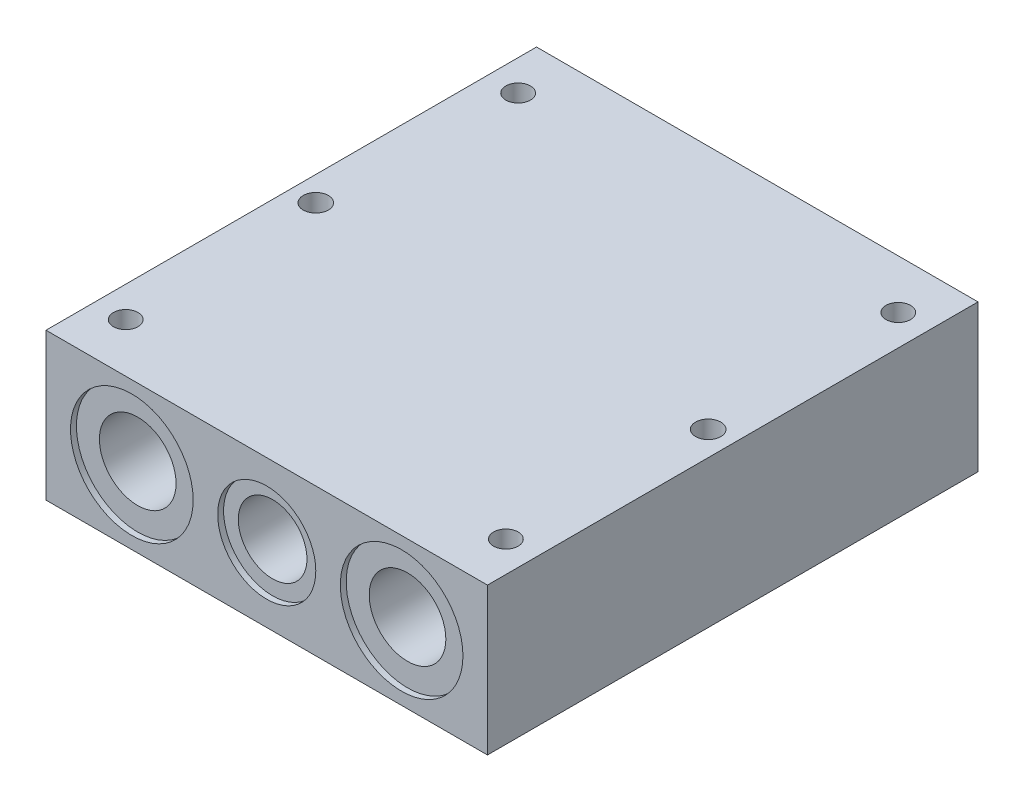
ISO-10303-21;
HEADER;
FILE_DESCRIPTION(('STEP AP214'),'2;1');
FILE_NAME('part.step','',(''),(''),'','','');
FILE_SCHEMA(('AUTOMOTIVE_DESIGN { 1 0 10303 214 1 1 1 1 }'));
ENDSEC;
DATA;
#1=APPLICATION_CONTEXT('core data for automotive mechanical design processes');
#2=APPLICATION_PROTOCOL_DEFINITION('international standard','automotive_design',2000,#1);
#3=PRODUCT_CONTEXT('',#1,'mechanical');
#4=PRODUCT('Part','Part','',(#3));
#5=PRODUCT_RELATED_PRODUCT_CATEGORY('part','',(#4));
#6=PRODUCT_DEFINITION_FORMATION('','',#4);
#7=PRODUCT_DEFINITION_CONTEXT('part definition',#1,'design');
#8=PRODUCT_DEFINITION('design','',#6,#7);
#9=PRODUCT_DEFINITION_SHAPE('','',#8);
#10=(LENGTH_UNIT() NAMED_UNIT(*) SI_UNIT(.MILLI.,.METRE.));
#11=(NAMED_UNIT(*) PLANE_ANGLE_UNIT() SI_UNIT($,.RADIAN.));
#12=(NAMED_UNIT(*) SI_UNIT($,.STERADIAN.) SOLID_ANGLE_UNIT());
#13=UNCERTAINTY_MEASURE_WITH_UNIT(LENGTH_MEASURE(1.E-05),#10,'distance_accuracy_value','');
#14=(GEOMETRIC_REPRESENTATION_CONTEXT(3) GLOBAL_UNCERTAINTY_ASSIGNED_CONTEXT((#13)) GLOBAL_UNIT_ASSIGNED_CONTEXT((#10,
#11,#12)) REPRESENTATION_CONTEXT('',''));
#15=CARTESIAN_POINT('',(0.,0.,0.));
#16=DIRECTION('',(0.,0.,1.));
#17=DIRECTION('',(1.,0.,0.));
#18=AXIS2_PLACEMENT_3D('',#15,#16,#17);
#19=CARTESIAN_POINT('',(0.,0.,-63.5));
#20=DIRECTION('',(0.,0.,1.));
#21=DIRECTION('',(1.,0.,0.));
#22=AXIS2_PLACEMENT_3D('',#19,#20,#21);
#23=CYLINDRICAL_SURFACE('',#22,8.89);
#24=CARTESIAN_POINT('',(0.,0.,61.976));
#25=DIRECTION('',(0.,0.,1.));
#26=DIRECTION('',(1.,0.,0.));
#27=AXIS2_PLACEMENT_3D('',#24,#25,#26);
#28=CIRCLE('',#27,8.89);
#29=CARTESIAN_POINT('',(8.89,0.,61.976));
#30=VERTEX_POINT('',#29);
#31=EDGE_CURVE('E128',#30,#30,#28,.F.);
#32=ORIENTED_EDGE('',*,*,#31,.F.);
#33=EDGE_LOOP('',(#32));
#34=FACE_BOUND('',#33,.T.);
#35=CARTESIAN_POINT('',(0.,0.,-61.976));
#36=DIRECTION('',(0.,0.,-1.));
#37=DIRECTION('',(-1.,0.,0.));
#38=AXIS2_PLACEMENT_3D('',#35,#36,#37);
#39=CIRCLE('',#38,8.89);
#40=CARTESIAN_POINT('',(-8.89,0.,-61.976));
#41=VERTEX_POINT('',#40);
#42=EDGE_CURVE('E39',#41,#41,#39,.F.);
#43=ORIENTED_EDGE('',*,*,#42,.F.);
#44=EDGE_LOOP('',(#43));
#45=FACE_BOUND('',#44,.T.);
#46=ADVANCED_FACE('F35',(#34,#45),#23,.F.);
#47=CARTESIAN_POINT('',(34.925,0.,-63.5));
#48=DIRECTION('',(0.,0.,1.));
#49=DIRECTION('',(1.,0.,0.));
#50=AXIS2_PLACEMENT_3D('',#47,#48,#49);
#51=CYLINDRICAL_SURFACE('',#50,9.921875);
#52=CARTESIAN_POINT('',(34.925,0.,61.976));
#53=DIRECTION('',(0.,0.,1.));
#54=DIRECTION('',(1.,0.,0.));
#55=AXIS2_PLACEMENT_3D('',#52,#53,#54);
#56=CIRCLE('',#55,9.921875);
#57=CARTESIAN_POINT('',(44.846875,0.,61.976));
#58=VERTEX_POINT('',#57);
#59=EDGE_CURVE('E105',#58,#58,#56,.F.);
#60=ORIENTED_EDGE('',*,*,#59,.F.);
#61=EDGE_LOOP('',(#60));
#62=FACE_BOUND('',#61,.T.);
#63=CARTESIAN_POINT('',(34.925,0.,-61.976));
#64=DIRECTION('',(0.,0.,-1.));
#65=DIRECTION('',(-1.,0.,0.));
#66=AXIS2_PLACEMENT_3D('',#63,#64,#65);
#67=CIRCLE('',#66,9.921875);
#68=CARTESIAN_POINT('',(25.003125,0.,-61.976));
#69=VERTEX_POINT('',#68);
#70=EDGE_CURVE('E124',#69,#69,#67,.F.);
#71=ORIENTED_EDGE('',*,*,#70,.F.);
#72=EDGE_LOOP('',(#71));
#73=FACE_BOUND('',#72,.T.);
#74=ADVANCED_FACE('F177',(#62,#73),#51,.F.);
#75=CARTESIAN_POINT('',(-34.925,0.,-63.5));
#76=DIRECTION('',(0.,0.,1.));
#77=DIRECTION('',(1.,0.,0.));
#78=AXIS2_PLACEMENT_3D('',#75,#76,#77);
#79=CYLINDRICAL_SURFACE('',#78,9.921875);
#80=CARTESIAN_POINT('',(-34.925,0.,61.976));
#81=DIRECTION('',(0.,0.,1.));
#82=DIRECTION('',(1.,0.,0.));
#83=AXIS2_PLACEMENT_3D('',#80,#81,#82);
#84=CIRCLE('',#83,9.921875);
#85=CARTESIAN_POINT('',(-25.003125,0.,61.976));
#86=VERTEX_POINT('',#85);
#87=EDGE_CURVE('E114',#86,#86,#84,.F.);
#88=ORIENTED_EDGE('',*,*,#87,.F.);
#89=EDGE_LOOP('',(#88));
#90=FACE_BOUND('',#89,.T.);
#91=CARTESIAN_POINT('',(-34.925,0.,-61.976));
#92=DIRECTION('',(0.,0.,-1.));
#93=DIRECTION('',(-1.,0.,0.));
#94=AXIS2_PLACEMENT_3D('',#91,#92,#93);
#95=CIRCLE('',#94,9.921875);
#96=CARTESIAN_POINT('',(-44.846875,0.,-61.976));
#97=VERTEX_POINT('',#96);
#98=EDGE_CURVE('E119',#97,#97,#95,.F.);
#99=ORIENTED_EDGE('',*,*,#98,.F.);
#100=EDGE_LOOP('',(#99));
#101=FACE_BOUND('',#100,.T.);
#102=ADVANCED_FACE('F172',(#90,#101),#79,.F.);
#103=CARTESIAN_POINT('',(-57.15,19.05,-63.5));
#104=DIRECTION('',(1.,0.,0.));
#105=DIRECTION('',(0.,0.,-1.));
#106=AXIS2_PLACEMENT_3D('',#103,#104,#105);
#107=PLANE('',#106);
#108=DIRECTION('',(0.,0.,1.));
#109=VECTOR('',#108,1.);
#110=CARTESIAN_POINT('',(-57.15,-19.05,-63.5));
#111=LINE('',#110,#109);
#112=CARTESIAN_POINT('',(-57.15,-19.05,-63.5));
#113=VERTEX_POINT('',#112);
#114=CARTESIAN_POINT('',(-57.15,-19.05,63.5));
#115=VERTEX_POINT('',#114);
#116=EDGE_CURVE('E102',#113,#115,#111,.T.);
#117=ORIENTED_EDGE('',*,*,#116,.T.);
#118=DIRECTION('',(0.,-1.,0.));
#119=VECTOR('',#118,1.);
#120=CARTESIAN_POINT('',(-57.15,19.05,63.5));
#121=LINE('',#120,#119);
#122=CARTESIAN_POINT('',(-57.15,19.05,63.5));
#123=VERTEX_POINT('',#122);
#124=EDGE_CURVE('E11',#123,#115,#121,.T.);
#125=ORIENTED_EDGE('',*,*,#124,.F.);
#126=DIRECTION('',(0.,0.,1.));
#127=VECTOR('',#126,1.);
#128=CARTESIAN_POINT('',(-57.15,19.05,-63.5));
#129=LINE('',#128,#127);
#130=CARTESIAN_POINT('',(-57.15,19.05,-63.5));
#131=VERTEX_POINT('',#130);
#132=EDGE_CURVE('E89',#131,#123,#129,.T.);
#133=ORIENTED_EDGE('',*,*,#132,.F.);
#134=DIRECTION('',(0.,-1.,0.));
#135=VECTOR('',#134,1.);
#136=CARTESIAN_POINT('',(-57.15,19.05,-63.5));
#137=LINE('',#136,#135);
#138=EDGE_CURVE('E98',#131,#113,#137,.T.);
#139=ORIENTED_EDGE('',*,*,#138,.T.);
#140=EDGE_LOOP('',(#117,#125,#133,#139));
#141=FACE_BOUND('',#140,.T.);
#142=ADVANCED_FACE('F37',(#141),#107,.F.);
#143=CARTESIAN_POINT('',(-57.15,19.05,63.5));
#144=DIRECTION('',(0.,0.,-1.));
#145=DIRECTION('',(-1.,0.,0.));
#146=AXIS2_PLACEMENT_3D('',#143,#144,#145);
#147=PLANE('',#146);
#148=CARTESIAN_POINT('',(0.,0.,63.5));
#149=DIRECTION('',(0.,0.,1.));
#150=DIRECTION('',(1.,0.,0.));
#151=AXIS2_PLACEMENT_3D('',#148,#149,#150);
#152=CIRCLE('',#151,12.7);
#153=CARTESIAN_POINT('',(12.7,0.,63.5));
#154=VERTEX_POINT('',#153);
#155=EDGE_CURVE('E137',#154,#154,#152,.T.);
#156=ORIENTED_EDGE('',*,*,#155,.F.);
#157=EDGE_LOOP('',(#156));
#158=FACE_BOUND('',#157,.T.);
#159=CARTESIAN_POINT('',(-34.925,0.,63.5));
#160=DIRECTION('',(0.,0.,1.));
#161=DIRECTION('',(1.,0.,0.));
#162=AXIS2_PLACEMENT_3D('',#159,#160,#161);
#163=CIRCLE('',#162,15.875);
#164=CARTESIAN_POINT('',(-19.05,0.,63.5));
#165=VERTEX_POINT('',#164);
#166=EDGE_CURVE('E122',#165,#165,#163,.T.);
#167=ORIENTED_EDGE('',*,*,#166,.F.);
#168=EDGE_LOOP('',(#167));
#169=FACE_BOUND('',#168,.T.);
#170=CARTESIAN_POINT('',(34.925,0.,63.5));
#171=DIRECTION('',(0.,0.,1.));
#172=DIRECTION('',(1.,0.,0.));
#173=AXIS2_PLACEMENT_3D('',#170,#171,#172);
#174=CIRCLE('',#173,15.875);
#175=CARTESIAN_POINT('',(50.8,0.,63.5));
#176=VERTEX_POINT('',#175);
#177=EDGE_CURVE('E117',#176,#176,#174,.T.);
#178=ORIENTED_EDGE('',*,*,#177,.F.);
#179=EDGE_LOOP('',(#178));
#180=FACE_BOUND('',#179,.T.);
#181=DIRECTION('',(1.,0.,0.));
#182=VECTOR('',#181,1.);
#183=CARTESIAN_POINT('',(-57.15,-19.05,63.5));
#184=LINE('',#183,#182);
#185=CARTESIAN_POINT('',(57.15,-19.05,63.5));
#186=VERTEX_POINT('',#185);
#187=EDGE_CURVE('E93',#115,#186,#184,.T.);
#188=ORIENTED_EDGE('',*,*,#187,.T.);
#189=DIRECTION('',(0.,-1.,0.));
#190=VECTOR('',#189,1.);
#191=CARTESIAN_POINT('',(57.15,19.05,63.5));
#192=LINE('',#191,#190);
#193=CARTESIAN_POINT('',(57.15,19.05,63.5));
#194=VERTEX_POINT('',#193);
#195=EDGE_CURVE('E45',#194,#186,#192,.T.);
#196=ORIENTED_EDGE('',*,*,#195,.F.);
#197=DIRECTION('',(1.,0.,0.));
#198=VECTOR('',#197,1.);
#199=CARTESIAN_POINT('',(-57.15,19.05,63.5));
#200=LINE('',#199,#198);
#201=EDGE_CURVE('E84',#123,#194,#200,.T.);
#202=ORIENTED_EDGE('',*,*,#201,.F.);
#203=ORIENTED_EDGE('',*,*,#124,.T.);
#204=EDGE_LOOP('',(#188,#196,#202,#203));
#205=FACE_BOUND('',#204,.T.);
#206=ADVANCED_FACE('F92',(#158,#169,#180,#205),#147,.F.);
#207=CARTESIAN_POINT('',(57.15,19.05,-63.5));
#208=DIRECTION('',(-1.,0.,0.));
#209=DIRECTION('',(0.,0.,1.));
#210=AXIS2_PLACEMENT_3D('',#207,#208,#209);
#211=PLANE('',#210);
#212=DIRECTION('',(0.,0.,-1.));
#213=VECTOR('',#212,1.);
#214=CARTESIAN_POINT('',(57.15,-19.05,-63.5));
#215=LINE('',#214,#213);
#216=CARTESIAN_POINT('',(57.15,-19.05,-63.5));
#217=VERTEX_POINT('',#216);
#218=EDGE_CURVE('E71',#186,#217,#215,.T.);
#219=ORIENTED_EDGE('',*,*,#218,.T.);
#220=DIRECTION('',(0.,-1.,0.));
#221=VECTOR('',#220,1.);
#222=CARTESIAN_POINT('',(57.15,19.05,-63.5));
#223=LINE('',#222,#221);
#224=CARTESIAN_POINT('',(57.15,19.05,-63.5));
#225=VERTEX_POINT('',#224);
#226=EDGE_CURVE('E94',#225,#217,#223,.T.);
#227=ORIENTED_EDGE('',*,*,#226,.F.);
#228=DIRECTION('',(0.,0.,-1.));
#229=VECTOR('',#228,1.);
#230=CARTESIAN_POINT('',(57.15,19.05,-63.5));
#231=LINE('',#230,#229);
#232=EDGE_CURVE('E87',#194,#225,#231,.T.);
#233=ORIENTED_EDGE('',*,*,#232,.F.);
#234=ORIENTED_EDGE('',*,*,#195,.T.);
#235=EDGE_LOOP('',(#219,#227,#233,#234));
#236=FACE_BOUND('',#235,.T.);
#237=ADVANCED_FACE('F96',(#236),#211,.F.);
#238=CARTESIAN_POINT('',(-57.15,19.05,-63.5));
#239=DIRECTION('',(0.,0.,1.));
#240=DIRECTION('',(1.,0.,0.));
#241=AXIS2_PLACEMENT_3D('',#238,#239,#240);
#242=PLANE('',#241);
#243=CARTESIAN_POINT('',(0.,0.,-63.5));
#244=DIRECTION('',(0.,0.,-1.));
#245=DIRECTION('',(-1.,0.,0.));
#246=AXIS2_PLACEMENT_3D('',#243,#244,#245);
#247=CIRCLE('',#246,12.7);
#248=CARTESIAN_POINT('',(-12.7,0.,-63.5));
#249=VERTEX_POINT('',#248);
#250=EDGE_CURVE('E144',#249,#249,#247,.T.);
#251=ORIENTED_EDGE('',*,*,#250,.F.);
#252=EDGE_LOOP('',(#251));
#253=FACE_BOUND('',#252,.T.);
#254=CARTESIAN_POINT('',(34.925,0.,-63.5));
#255=DIRECTION('',(0.,0.,-1.));
#256=DIRECTION('',(-1.,0.,0.));
#257=AXIS2_PLACEMENT_3D('',#254,#255,#256);
#258=CIRCLE('',#257,15.875);
#259=CARTESIAN_POINT('',(19.05,0.,-63.5));
#260=VERTEX_POINT('',#259);
#261=EDGE_CURVE('E130',#260,#260,#258,.T.);
#262=ORIENTED_EDGE('',*,*,#261,.F.);
#263=EDGE_LOOP('',(#262));
#264=FACE_BOUND('',#263,.T.);
#265=CARTESIAN_POINT('',(-34.925,0.,-63.5));
#266=DIRECTION('',(0.,0.,-1.));
#267=DIRECTION('',(-1.,0.,0.));
#268=AXIS2_PLACEMENT_3D('',#265,#266,#267);
#269=CIRCLE('',#268,15.875);
#270=CARTESIAN_POINT('',(-50.8,0.,-63.5));
#271=VERTEX_POINT('',#270);
#272=EDGE_CURVE('E126',#271,#271,#269,.T.);
#273=ORIENTED_EDGE('',*,*,#272,.F.);
#274=EDGE_LOOP('',(#273));
#275=FACE_BOUND('',#274,.T.);
#276=DIRECTION('',(-1.,0.,0.));
#277=VECTOR('',#276,1.);
#278=CARTESIAN_POINT('',(-57.15,-19.05,-63.5));
#279=LINE('',#278,#277);
#280=EDGE_CURVE('E77',#217,#113,#279,.T.);
#281=ORIENTED_EDGE('',*,*,#280,.T.);
#282=ORIENTED_EDGE('',*,*,#138,.F.);
#283=DIRECTION('',(-1.,0.,0.));
#284=VECTOR('',#283,1.);
#285=CARTESIAN_POINT('',(-57.15,19.05,-63.5));
#286=LINE('',#285,#284);
#287=EDGE_CURVE('E54',#225,#131,#286,.T.);
#288=ORIENTED_EDGE('',*,*,#287,.F.);
#289=ORIENTED_EDGE('',*,*,#226,.T.);
#290=EDGE_LOOP('',(#281,#282,#288,#289));
#291=FACE_BOUND('',#290,.T.);
#292=ADVANCED_FACE('F170',(#253,#264,#275,#291),#242,.F.);
#293=CARTESIAN_POINT('',(-57.15,19.05,63.5));
#294=DIRECTION('',(0.,1.,0.));
#295=DIRECTION('',(0.,0.,1.));
#296=AXIS2_PLACEMENT_3D('',#293,#294,#295);
#297=PLANE('',#296);
#298=CARTESIAN_POINT('',(-49.2125,19.05,50.8));
#299=DIRECTION('',(0.,1.,0.));
#300=DIRECTION('',(0.,0.,1.));
#301=AXIS2_PLACEMENT_3D('',#298,#299,#300);
#302=CIRCLE('',#301,3.18770000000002);
#303=CARTESIAN_POINT('',(-49.2125,19.05,53.9877));
#304=VERTEX_POINT('',#303);
#305=EDGE_CURVE('E283',#304,#304,#302,.T.);
#306=ORIENTED_EDGE('',*,*,#305,.F.);
#307=EDGE_LOOP('',(#306));
#308=FACE_BOUND('',#307,.T.);
#309=CARTESIAN_POINT('',(-49.2125,19.05,-50.8));
#310=DIRECTION('',(0.,1.,0.));
#311=DIRECTION('',(0.,0.,1.));
#312=AXIS2_PLACEMENT_3D('',#309,#310,#311);
#313=CIRCLE('',#312,3.18770000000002);
#314=CARTESIAN_POINT('',(-49.2125,19.05,-47.6123));
#315=VERTEX_POINT('',#314);
#316=EDGE_CURVE('E277',#315,#315,#313,.T.);
#317=ORIENTED_EDGE('',*,*,#316,.F.);
#318=EDGE_LOOP('',(#317));
#319=FACE_BOUND('',#318,.T.);
#320=CARTESIAN_POINT('',(49.2125,19.05,-50.8));
#321=DIRECTION('',(0.,1.,0.));
#322=DIRECTION('',(0.,0.,1.));
#323=AXIS2_PLACEMENT_3D('',#320,#321,#322);
#324=CIRCLE('',#323,3.18770000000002);
#325=CARTESIAN_POINT('',(49.2125,19.05,-47.6123));
#326=VERTEX_POINT('',#325);
#327=EDGE_CURVE('E271',#326,#326,#324,.T.);
#328=ORIENTED_EDGE('',*,*,#327,.F.);
#329=EDGE_LOOP('',(#328));
#330=FACE_BOUND('',#329,.T.);
#331=CARTESIAN_POINT('',(49.2125,19.05,50.8));
#332=DIRECTION('',(0.,1.,0.));
#333=DIRECTION('',(0.,0.,1.));
#334=AXIS2_PLACEMENT_3D('',#331,#332,#333);
#335=CIRCLE('',#334,3.18770000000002);
#336=CARTESIAN_POINT('',(49.2125,19.05,53.9877));
#337=VERTEX_POINT('',#336);
#338=EDGE_CURVE('E265',#337,#337,#335,.T.);
#339=ORIENTED_EDGE('',*,*,#338,.F.);
#340=EDGE_LOOP('',(#339));
#341=FACE_BOUND('',#340,.T.);
#342=CARTESIAN_POINT('',(-50.8,19.05,0.));
#343=DIRECTION('',(0.,1.,0.));
#344=DIRECTION('',(0.,0.,1.));
#345=AXIS2_PLACEMENT_3D('',#342,#343,#344);
#346=CIRCLE('',#345,3.26389999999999);
#347=CARTESIAN_POINT('',(-50.8,19.05,3.26389999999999));
#348=VERTEX_POINT('',#347);
#349=EDGE_CURVE('E254',#348,#348,#346,.T.);
#350=ORIENTED_EDGE('',*,*,#349,.F.);
#351=EDGE_LOOP('',(#350));
#352=FACE_BOUND('',#351,.T.);
#353=CARTESIAN_POINT('',(50.8,19.05,0.));
#354=DIRECTION('',(0.,1.,0.));
#355=DIRECTION('',(0.,0.,1.));
#356=AXIS2_PLACEMENT_3D('',#353,#354,#355);
#357=CIRCLE('',#356,3.26389999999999);
#358=CARTESIAN_POINT('',(50.8,19.05,3.26389999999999));
#359=VERTEX_POINT('',#358);
#360=EDGE_CURVE('E246',#359,#359,#357,.T.);
#361=ORIENTED_EDGE('',*,*,#360,.F.);
#362=EDGE_LOOP('',(#361));
#363=FACE_BOUND('',#362,.T.);
#364=ORIENTED_EDGE('',*,*,#132,.T.);
#365=ORIENTED_EDGE('',*,*,#201,.T.);
#366=ORIENTED_EDGE('',*,*,#232,.T.);
#367=ORIENTED_EDGE('',*,*,#287,.T.);
#368=EDGE_LOOP('',(#364,#365,#366,#367));
#369=FACE_BOUND('',#368,.T.);
#370=ADVANCED_FACE('F85',(#308,#319,#330,#341,#352,#363,#369),#297,.T.);
#371=CARTESIAN_POINT('',(-57.15,-19.05,63.5));
#372=DIRECTION('',(0.,1.,0.));
#373=DIRECTION('',(0.,0.,1.));
#374=AXIS2_PLACEMENT_3D('',#371,#372,#373);
#375=PLANE('',#374);
#376=CARTESIAN_POINT('',(-50.8,-19.05,0.));
#377=DIRECTION('',(0.,1.,0.));
#378=DIRECTION('',(0.,0.,1.));
#379=AXIS2_PLACEMENT_3D('',#376,#377,#378);
#380=CIRCLE('',#379,3.26389999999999);
#381=CARTESIAN_POINT('',(-50.8,-19.05,3.26389999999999));
#382=VERTEX_POINT('',#381);
#383=EDGE_CURVE('E259',#382,#382,#380,.T.);
#384=ORIENTED_EDGE('',*,*,#383,.T.);
#385=EDGE_LOOP('',(#384));
#386=FACE_BOUND('',#385,.T.);
#387=CARTESIAN_POINT('',(50.8,-19.05,0.));
#388=DIRECTION('',(0.,1.,0.));
#389=DIRECTION('',(0.,0.,1.));
#390=AXIS2_PLACEMENT_3D('',#387,#388,#389);
#391=CIRCLE('',#390,3.26389999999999);
#392=CARTESIAN_POINT('',(50.8,-19.05,3.26389999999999));
#393=VERTEX_POINT('',#392);
#394=EDGE_CURVE('E249',#393,#393,#391,.T.);
#395=ORIENTED_EDGE('',*,*,#394,.T.);
#396=EDGE_LOOP('',(#395));
#397=FACE_BOUND('',#396,.T.);
#398=ORIENTED_EDGE('',*,*,#116,.F.);
#399=ORIENTED_EDGE('',*,*,#280,.F.);
#400=ORIENTED_EDGE('',*,*,#218,.F.);
#401=ORIENTED_EDGE('',*,*,#187,.F.);
#402=EDGE_LOOP('',(#398,#399,#400,#401));
#403=FACE_BOUND('',#402,.T.);
#404=ADVANCED_FACE('F218',(#386,#397,#403),#375,.F.);
#405=CARTESIAN_POINT('',(34.925,0.,61.976));
#406=DIRECTION('',(0.,0.,1.));
#407=DIRECTION('',(1.,0.,0.));
#408=AXIS2_PLACEMENT_3D('',#405,#406,#407);
#409=PLANE('',#408);
#410=CARTESIAN_POINT('',(34.925,0.,61.976));
#411=DIRECTION('',(0.,0.,1.));
#412=DIRECTION('',(1.,0.,0.));
#413=AXIS2_PLACEMENT_3D('',#410,#411,#412);
#414=CIRCLE('',#413,15.875);
#415=CARTESIAN_POINT('',(50.8,0.,61.976));
#416=VERTEX_POINT('',#415);
#417=EDGE_CURVE('E113',#416,#416,#414,.T.);
#418=ORIENTED_EDGE('',*,*,#417,.T.);
#419=EDGE_LOOP('',(#418));
#420=FACE_BOUND('',#419,.T.);
#421=ORIENTED_EDGE('',*,*,#59,.T.);
#422=EDGE_LOOP('',(#421));
#423=FACE_BOUND('',#422,.T.);
#424=ADVANCED_FACE('F215',(#420,#423),#409,.T.);
#425=CARTESIAN_POINT('',(34.925,0.,61.976));
#426=DIRECTION('',(0.,0.,1.));
#427=DIRECTION('',(1.,0.,0.));
#428=AXIS2_PLACEMENT_3D('',#425,#426,#427);
#429=CYLINDRICAL_SURFACE('',#428,15.875);
#430=CARTESIAN_POINT('',(50.8,0.,61.976));
#431=CARTESIAN_POINT('',(50.8,0.,61.991875));
#432=CARTESIAN_POINT('',(50.8,0.,62.00775));
#433=CARTESIAN_POINT('',(50.8,0.,62.0395));
#434=CARTESIAN_POINT('',(50.8,0.,62.055375));
#435=CARTESIAN_POINT('',(50.8,0.,62.087125));
#436=CARTESIAN_POINT('',(50.8,0.,62.103));
#437=CARTESIAN_POINT('',(50.8,0.,62.13475));
#438=CARTESIAN_POINT('',(50.8,0.,62.150625));
#439=CARTESIAN_POINT('',(50.8,0.,62.182375));
#440=CARTESIAN_POINT('',(50.8,0.,62.19825));
#441=CARTESIAN_POINT('',(50.8,0.,62.23));
#442=CARTESIAN_POINT('',(50.8,0.,62.245875));
#443=CARTESIAN_POINT('',(50.8,0.,62.277625));
#444=CARTESIAN_POINT('',(50.8,0.,62.2935));
#445=CARTESIAN_POINT('',(50.8,0.,62.32525));
#446=CARTESIAN_POINT('',(50.8,0.,62.341125));
#447=CARTESIAN_POINT('',(50.8,0.,62.372875));
#448=CARTESIAN_POINT('',(50.8,0.,62.38875));
#449=CARTESIAN_POINT('',(50.8,0.,62.4205));
#450=CARTESIAN_POINT('',(50.8,0.,62.436375));
#451=CARTESIAN_POINT('',(50.8,0.,62.468125));
#452=CARTESIAN_POINT('',(50.8,0.,62.484));
#453=CARTESIAN_POINT('',(50.8,0.,62.51575));
#454=CARTESIAN_POINT('',(50.8,0.,62.531625));
#455=CARTESIAN_POINT('',(50.8,0.,62.563375));
#456=CARTESIAN_POINT('',(50.8,0.,62.57925));
#457=CARTESIAN_POINT('',(50.8,0.,62.611));
#458=CARTESIAN_POINT('',(50.8,0.,62.626875));
#459=CARTESIAN_POINT('',(50.8,0.,62.658625));
#460=CARTESIAN_POINT('',(50.8,0.,62.6745));
#461=CARTESIAN_POINT('',(50.8,0.,62.70625));
#462=CARTESIAN_POINT('',(50.8,0.,62.722125));
#463=CARTESIAN_POINT('',(50.8,0.,62.753875));
#464=CARTESIAN_POINT('',(50.8,0.,62.76975));
#465=CARTESIAN_POINT('',(50.8,0.,62.8015));
#466=CARTESIAN_POINT('',(50.8,0.,62.817375));
#467=CARTESIAN_POINT('',(50.8,0.,62.849125));
#468=CARTESIAN_POINT('',(50.8,0.,62.865));
#469=CARTESIAN_POINT('',(50.8,0.,62.89675));
#470=CARTESIAN_POINT('',(50.8,0.,62.912625));
#471=CARTESIAN_POINT('',(50.8,0.,62.944375));
#472=CARTESIAN_POINT('',(50.8,0.,62.96025));
#473=CARTESIAN_POINT('',(50.8,0.,62.992));
#474=CARTESIAN_POINT('',(50.8,0.,63.007875));
#475=CARTESIAN_POINT('',(50.8,0.,63.039625));
#476=CARTESIAN_POINT('',(50.8,0.,63.0555));
#477=CARTESIAN_POINT('',(50.8,0.,63.08725));
#478=CARTESIAN_POINT('',(50.8,0.,63.103125));
#479=CARTESIAN_POINT('',(50.8,0.,63.134875));
#480=CARTESIAN_POINT('',(50.8,0.,63.15075));
#481=CARTESIAN_POINT('',(50.8,0.,63.1825));
#482=CARTESIAN_POINT('',(50.8,0.,63.198375));
#483=CARTESIAN_POINT('',(50.8,0.,63.230125));
#484=CARTESIAN_POINT('',(50.8,0.,63.246));
#485=CARTESIAN_POINT('',(50.8,0.,63.27775));
#486=CARTESIAN_POINT('',(50.8,0.,63.293625));
#487=CARTESIAN_POINT('',(50.8,0.,63.325375));
#488=CARTESIAN_POINT('',(50.8,0.,63.34125));
#489=CARTESIAN_POINT('',(50.8,0.,63.373));
#490=CARTESIAN_POINT('',(50.8,0.,63.388875));
#491=CARTESIAN_POINT('',(50.8,0.,63.420625));
#492=CARTESIAN_POINT('',(50.8,0.,63.4365));
#493=CARTESIAN_POINT('',(50.8,0.,63.46825));
#494=CARTESIAN_POINT('',(50.8,0.,63.484125));
#495=CARTESIAN_POINT('',(50.8,0.,63.5));
#496=B_SPLINE_CURVE_WITH_KNOTS('',3,(#430,#431,#432,#433,#434,#435,#436,#437,#438,#439,#440,
#441,#442,#443,#444,#445,#446,#447,#448,#449,#450,#451,#452,#453,#454,#455,#456,#457,#458,#459,
#460,#461,#462,#463,#464,#465,#466,#467,#468,#469,#470,#471,#472,#473,#474,#475,#476,#477,#478,
#479,#480,#481,#482,#483,#484,#485,#486,#487,#488,#489,#490,#491,#492,#493,#494,#495),
.UNSPECIFIED.,.F.,.F.,(4,2,2,2,2,2,2,2,2,2,2,2,2,2,2,2,2,2,2,2,2,2,2,2,2,2,2,2,2,2,2,2,4),(0.,
0.0476250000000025,0.0952500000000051,0.142875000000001,0.190500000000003,0.238125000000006,
0.285750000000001,0.333375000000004,0.380999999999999,0.428625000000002,0.476250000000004,
0.523875,0.571499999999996,0.619125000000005,0.666750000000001,0.714374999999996,
0.762000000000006,0.809625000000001,0.857249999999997,0.904875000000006,0.952500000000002,
1.000125,1.04774999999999,1.095375,1.143,1.19062499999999,1.23825,1.285875,1.33349999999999,
1.381125,1.42875,1.476375,1.52399999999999),.UNSPECIFIED.);
#497=EDGE_CURVE('BSEAM162',#416,#176,#496,.T.);
#498=ORIENTED_EDGE('',*,*,#417,.F.);
#499=ORIENTED_EDGE('',*,*,#177,.T.);
#500=ORIENTED_EDGE('',*,*,#497,.T.);
#501=ORIENTED_EDGE('',*,*,#497,.F.);
#502=EDGE_LOOP('',(#498,#500,#499,#501));
#503=FACE_BOUND('',#502,.T.);
#504=ADVANCED_FACE('F162',(#503),#429,.F.);
#505=CARTESIAN_POINT('',(-34.925,0.,61.976));
#506=DIRECTION('',(0.,0.,1.));
#507=DIRECTION('',(1.,0.,0.));
#508=AXIS2_PLACEMENT_3D('',#505,#506,#507);
#509=PLANE('',#508);
#510=CARTESIAN_POINT('',(-34.925,0.,61.976));
#511=DIRECTION('',(0.,0.,1.));
#512=DIRECTION('',(1.,0.,0.));
#513=AXIS2_PLACEMENT_3D('',#510,#511,#512);
#514=CIRCLE('',#513,15.875);
#515=CARTESIAN_POINT('',(-19.05,0.,61.976));
#516=VERTEX_POINT('',#515);
#517=EDGE_CURVE('E118',#516,#516,#514,.T.);
#518=ORIENTED_EDGE('',*,*,#517,.T.);
#519=EDGE_LOOP('',(#518));
#520=FACE_BOUND('',#519,.T.);
#521=ORIENTED_EDGE('',*,*,#87,.T.);
#522=EDGE_LOOP('',(#521));
#523=FACE_BOUND('',#522,.T.);
#524=ADVANCED_FACE('F208',(#520,#523),#509,.T.);
#525=CARTESIAN_POINT('',(-34.925,0.,61.976));
#526=DIRECTION('',(0.,0.,1.));
#527=DIRECTION('',(1.,0.,0.));
#528=AXIS2_PLACEMENT_3D('',#525,#526,#527);
#529=CYLINDRICAL_SURFACE('',#528,15.875);
#530=CARTESIAN_POINT('',(-19.05,0.,61.976));
#531=CARTESIAN_POINT('',(-19.05,0.,61.991875));
#532=CARTESIAN_POINT('',(-19.05,0.,62.00775));
#533=CARTESIAN_POINT('',(-19.05,0.,62.0395));
#534=CARTESIAN_POINT('',(-19.05,0.,62.055375));
#535=CARTESIAN_POINT('',(-19.05,0.,62.087125));
#536=CARTESIAN_POINT('',(-19.05,0.,62.103));
#537=CARTESIAN_POINT('',(-19.05,0.,62.13475));
#538=CARTESIAN_POINT('',(-19.05,0.,62.150625));
#539=CARTESIAN_POINT('',(-19.05,0.,62.182375));
#540=CARTESIAN_POINT('',(-19.05,0.,62.19825));
#541=CARTESIAN_POINT('',(-19.05,0.,62.23));
#542=CARTESIAN_POINT('',(-19.05,0.,62.245875));
#543=CARTESIAN_POINT('',(-19.05,0.,62.277625));
#544=CARTESIAN_POINT('',(-19.05,0.,62.2935));
#545=CARTESIAN_POINT('',(-19.05,0.,62.32525));
#546=CARTESIAN_POINT('',(-19.05,0.,62.341125));
#547=CARTESIAN_POINT('',(-19.05,0.,62.372875));
#548=CARTESIAN_POINT('',(-19.05,0.,62.38875));
#549=CARTESIAN_POINT('',(-19.05,0.,62.4205));
#550=CARTESIAN_POINT('',(-19.05,0.,62.436375));
#551=CARTESIAN_POINT('',(-19.05,0.,62.468125));
#552=CARTESIAN_POINT('',(-19.05,0.,62.484));
#553=CARTESIAN_POINT('',(-19.05,0.,62.51575));
#554=CARTESIAN_POINT('',(-19.05,0.,62.531625));
#555=CARTESIAN_POINT('',(-19.05,0.,62.563375));
#556=CARTESIAN_POINT('',(-19.05,0.,62.57925));
#557=CARTESIAN_POINT('',(-19.05,0.,62.611));
#558=CARTESIAN_POINT('',(-19.05,0.,62.626875));
#559=CARTESIAN_POINT('',(-19.05,0.,62.658625));
#560=CARTESIAN_POINT('',(-19.05,0.,62.6745));
#561=CARTESIAN_POINT('',(-19.05,0.,62.70625));
#562=CARTESIAN_POINT('',(-19.05,0.,62.722125));
#563=CARTESIAN_POINT('',(-19.05,0.,62.753875));
#564=CARTESIAN_POINT('',(-19.05,0.,62.76975));
#565=CARTESIAN_POINT('',(-19.05,0.,62.8015));
#566=CARTESIAN_POINT('',(-19.05,0.,62.817375));
#567=CARTESIAN_POINT('',(-19.05,0.,62.849125));
#568=CARTESIAN_POINT('',(-19.05,0.,62.865));
#569=CARTESIAN_POINT('',(-19.05,0.,62.89675));
#570=CARTESIAN_POINT('',(-19.05,0.,62.912625));
#571=CARTESIAN_POINT('',(-19.05,0.,62.944375));
#572=CARTESIAN_POINT('',(-19.05,0.,62.96025));
#573=CARTESIAN_POINT('',(-19.05,0.,62.992));
#574=CARTESIAN_POINT('',(-19.05,0.,63.007875));
#575=CARTESIAN_POINT('',(-19.05,0.,63.039625));
#576=CARTESIAN_POINT('',(-19.05,0.,63.0555));
#577=CARTESIAN_POINT('',(-19.05,0.,63.08725));
#578=CARTESIAN_POINT('',(-19.05,0.,63.103125));
#579=CARTESIAN_POINT('',(-19.05,0.,63.134875));
#580=CARTESIAN_POINT('',(-19.05,0.,63.15075));
#581=CARTESIAN_POINT('',(-19.05,0.,63.1825));
#582=CARTESIAN_POINT('',(-19.05,0.,63.198375));
#583=CARTESIAN_POINT('',(-19.05,0.,63.230125));
#584=CARTESIAN_POINT('',(-19.05,0.,63.246));
#585=CARTESIAN_POINT('',(-19.05,0.,63.27775));
#586=CARTESIAN_POINT('',(-19.05,0.,63.293625));
#587=CARTESIAN_POINT('',(-19.05,0.,63.325375));
#588=CARTESIAN_POINT('',(-19.05,0.,63.34125));
#589=CARTESIAN_POINT('',(-19.05,0.,63.373));
#590=CARTESIAN_POINT('',(-19.05,0.,63.388875));
#591=CARTESIAN_POINT('',(-19.05,0.,63.420625));
#592=CARTESIAN_POINT('',(-19.05,0.,63.4365));
#593=CARTESIAN_POINT('',(-19.05,0.,63.46825));
#594=CARTESIAN_POINT('',(-19.05,0.,63.484125));
#595=CARTESIAN_POINT('',(-19.05,0.,63.5));
#596=B_SPLINE_CURVE_WITH_KNOTS('',3,(#530,#531,#532,#533,#534,#535,#536,#537,#538,#539,#540,
#541,#542,#543,#544,#545,#546,#547,#548,#549,#550,#551,#552,#553,#554,#555,#556,#557,#558,#559,
#560,#561,#562,#563,#564,#565,#566,#567,#568,#569,#570,#571,#572,#573,#574,#575,#576,#577,#578,
#579,#580,#581,#582,#583,#584,#585,#586,#587,#588,#589,#590,#591,#592,#593,#594,#595),
.UNSPECIFIED.,.F.,.F.,(4,2,2,2,2,2,2,2,2,2,2,2,2,2,2,2,2,2,2,2,2,2,2,2,2,2,2,2,2,2,2,2,4),(0.,
0.0476250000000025,0.0952500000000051,0.142875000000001,0.190500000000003,0.238125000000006,
0.285750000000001,0.333375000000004,0.380999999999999,0.428625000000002,0.476250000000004,
0.523875,0.571499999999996,0.619125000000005,0.666750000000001,0.714374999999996,
0.762000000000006,0.809625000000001,0.857249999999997,0.904875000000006,0.952500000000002,
1.000125,1.04774999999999,1.095375,1.143,1.19062499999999,1.23825,1.285875,1.33349999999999,
1.381125,1.42875,1.476375,1.52399999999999),.UNSPECIFIED.);
#597=EDGE_CURVE('BSEAM203',#516,#165,#596,.T.);
#598=ORIENTED_EDGE('',*,*,#517,.F.);
#599=ORIENTED_EDGE('',*,*,#166,.T.);
#600=ORIENTED_EDGE('',*,*,#597,.T.);
#601=ORIENTED_EDGE('',*,*,#597,.F.);
#602=EDGE_LOOP('',(#598,#600,#599,#601));
#603=FACE_BOUND('',#602,.T.);
#604=ADVANCED_FACE('F203',(#603),#529,.F.);
#605=CARTESIAN_POINT('',(-34.925,0.,-61.976));
#606=DIRECTION('',(0.,0.,-1.));
#607=DIRECTION('',(-1.,0.,0.));
#608=AXIS2_PLACEMENT_3D('',#605,#606,#607);
#609=PLANE('',#608);
#610=CARTESIAN_POINT('',(-34.925,0.,-61.976));
#611=DIRECTION('',(0.,0.,-1.));
#612=DIRECTION('',(-1.,0.,0.));
#613=AXIS2_PLACEMENT_3D('',#610,#611,#612);
#614=CIRCLE('',#613,15.875);
#615=CARTESIAN_POINT('',(-50.8,0.,-61.976));
#616=VERTEX_POINT('',#615);
#617=EDGE_CURVE('E123',#616,#616,#614,.T.);
#618=ORIENTED_EDGE('',*,*,#617,.T.);
#619=EDGE_LOOP('',(#618));
#620=FACE_BOUND('',#619,.T.);
#621=ORIENTED_EDGE('',*,*,#98,.T.);
#622=EDGE_LOOP('',(#621));
#623=FACE_BOUND('',#622,.T.);
#624=ADVANCED_FACE('F200',(#620,#623),#609,.T.);
#625=CARTESIAN_POINT('',(-34.925,0.,-61.976));
#626=DIRECTION('',(0.,0.,-1.));
#627=DIRECTION('',(-1.,0.,0.));
#628=AXIS2_PLACEMENT_3D('',#625,#626,#627);
#629=CYLINDRICAL_SURFACE('',#628,15.875);
#630=CARTESIAN_POINT('',(-50.8,0.,-61.976));
#631=CARTESIAN_POINT('',(-50.8,0.,-61.991875));
#632=CARTESIAN_POINT('',(-50.8,0.,-62.00775));
#633=CARTESIAN_POINT('',(-50.8,0.,-62.0395));
#634=CARTESIAN_POINT('',(-50.8,0.,-62.055375));
#635=CARTESIAN_POINT('',(-50.8,0.,-62.087125));
#636=CARTESIAN_POINT('',(-50.8,0.,-62.103));
#637=CARTESIAN_POINT('',(-50.8,0.,-62.13475));
#638=CARTESIAN_POINT('',(-50.8,0.,-62.150625));
#639=CARTESIAN_POINT('',(-50.8,0.,-62.182375));
#640=CARTESIAN_POINT('',(-50.8,0.,-62.19825));
#641=CARTESIAN_POINT('',(-50.8,0.,-62.23));
#642=CARTESIAN_POINT('',(-50.8,0.,-62.245875));
#643=CARTESIAN_POINT('',(-50.8,0.,-62.277625));
#644=CARTESIAN_POINT('',(-50.8,0.,-62.2935));
#645=CARTESIAN_POINT('',(-50.8,0.,-62.32525));
#646=CARTESIAN_POINT('',(-50.8,0.,-62.341125));
#647=CARTESIAN_POINT('',(-50.8,0.,-62.372875));
#648=CARTESIAN_POINT('',(-50.8,0.,-62.38875));
#649=CARTESIAN_POINT('',(-50.8,0.,-62.4205));
#650=CARTESIAN_POINT('',(-50.8,0.,-62.436375));
#651=CARTESIAN_POINT('',(-50.8,0.,-62.468125));
#652=CARTESIAN_POINT('',(-50.8,0.,-62.484));
#653=CARTESIAN_POINT('',(-50.8,0.,-62.51575));
#654=CARTESIAN_POINT('',(-50.8,0.,-62.531625));
#655=CARTESIAN_POINT('',(-50.8,0.,-62.563375));
#656=CARTESIAN_POINT('',(-50.8,0.,-62.57925));
#657=CARTESIAN_POINT('',(-50.8,0.,-62.611));
#658=CARTESIAN_POINT('',(-50.8,0.,-62.626875));
#659=CARTESIAN_POINT('',(-50.8,0.,-62.658625));
#660=CARTESIAN_POINT('',(-50.8,0.,-62.6745));
#661=CARTESIAN_POINT('',(-50.8,0.,-62.70625));
#662=CARTESIAN_POINT('',(-50.8,0.,-62.722125));
#663=CARTESIAN_POINT('',(-50.8,0.,-62.753875));
#664=CARTESIAN_POINT('',(-50.8,0.,-62.76975));
#665=CARTESIAN_POINT('',(-50.8,0.,-62.8015));
#666=CARTESIAN_POINT('',(-50.8,0.,-62.817375));
#667=CARTESIAN_POINT('',(-50.8,0.,-62.849125));
#668=CARTESIAN_POINT('',(-50.8,0.,-62.865));
#669=CARTESIAN_POINT('',(-50.8,0.,-62.89675));
#670=CARTESIAN_POINT('',(-50.8,0.,-62.912625));
#671=CARTESIAN_POINT('',(-50.8,0.,-62.944375));
#672=CARTESIAN_POINT('',(-50.8,0.,-62.96025));
#673=CARTESIAN_POINT('',(-50.8,0.,-62.992));
#674=CARTESIAN_POINT('',(-50.8,0.,-63.007875));
#675=CARTESIAN_POINT('',(-50.8,0.,-63.039625));
#676=CARTESIAN_POINT('',(-50.8,0.,-63.0555));
#677=CARTESIAN_POINT('',(-50.8,0.,-63.08725));
#678=CARTESIAN_POINT('',(-50.8,0.,-63.103125));
#679=CARTESIAN_POINT('',(-50.8,0.,-63.134875));
#680=CARTESIAN_POINT('',(-50.8,0.,-63.15075));
#681=CARTESIAN_POINT('',(-50.8,0.,-63.1825));
#682=CARTESIAN_POINT('',(-50.8,0.,-63.198375));
#683=CARTESIAN_POINT('',(-50.8,0.,-63.230125));
#684=CARTESIAN_POINT('',(-50.8,0.,-63.246));
#685=CARTESIAN_POINT('',(-50.8,0.,-63.27775));
#686=CARTESIAN_POINT('',(-50.8,0.,-63.293625));
#687=CARTESIAN_POINT('',(-50.8,0.,-63.325375));
#688=CARTESIAN_POINT('',(-50.8,0.,-63.34125));
#689=CARTESIAN_POINT('',(-50.8,0.,-63.373));
#690=CARTESIAN_POINT('',(-50.8,0.,-63.388875));
#691=CARTESIAN_POINT('',(-50.8,0.,-63.420625));
#692=CARTESIAN_POINT('',(-50.8,0.,-63.4365));
#693=CARTESIAN_POINT('',(-50.8,0.,-63.46825));
#694=CARTESIAN_POINT('',(-50.8,0.,-63.484125));
#695=CARTESIAN_POINT('',(-50.8,0.,-63.5));
#696=B_SPLINE_CURVE_WITH_KNOTS('',3,(#630,#631,#632,#633,#634,#635,#636,#637,#638,#639,#640,
#641,#642,#643,#644,#645,#646,#647,#648,#649,#650,#651,#652,#653,#654,#655,#656,#657,#658,#659,
#660,#661,#662,#663,#664,#665,#666,#667,#668,#669,#670,#671,#672,#673,#674,#675,#676,#677,#678,
#679,#680,#681,#682,#683,#684,#685,#686,#687,#688,#689,#690,#691,#692,#693,#694,#695),
.UNSPECIFIED.,.F.,.F.,(4,2,2,2,2,2,2,2,2,2,2,2,2,2,2,2,2,2,2,2,2,2,2,2,2,2,2,2,2,2,2,2,4),(0.,
0.0476250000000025,0.0952500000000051,0.142875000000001,0.190500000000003,0.238125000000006,
0.285750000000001,0.333375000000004,0.380999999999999,0.428625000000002,0.476250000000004,
0.523875,0.571499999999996,0.619125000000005,0.666750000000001,0.714374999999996,
0.762000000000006,0.809625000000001,0.857249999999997,0.904875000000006,0.952500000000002,
1.000125,1.04774999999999,1.095375,1.143,1.19062499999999,1.23825,1.285875,1.33349999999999,
1.381125,1.42875,1.476375,1.52399999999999),.UNSPECIFIED.);
#697=EDGE_CURVE('BSEAM194',#616,#271,#696,.T.);
#698=ORIENTED_EDGE('',*,*,#617,.F.);
#699=ORIENTED_EDGE('',*,*,#272,.T.);
#700=ORIENTED_EDGE('',*,*,#697,.T.);
#701=ORIENTED_EDGE('',*,*,#697,.F.);
#702=EDGE_LOOP('',(#698,#700,#699,#701));
#703=FACE_BOUND('',#702,.T.);
#704=ADVANCED_FACE('F194',(#703),#629,.F.);
#705=CARTESIAN_POINT('',(34.925,0.,-61.976));
#706=DIRECTION('',(0.,0.,-1.));
#707=DIRECTION('',(-1.,0.,0.));
#708=AXIS2_PLACEMENT_3D('',#705,#706,#707);
#709=PLANE('',#708);
#710=CARTESIAN_POINT('',(34.925,0.,-61.976));
#711=DIRECTION('',(0.,0.,-1.));
#712=DIRECTION('',(-1.,0.,0.));
#713=AXIS2_PLACEMENT_3D('',#710,#711,#712);
#714=CIRCLE('',#713,15.875);
#715=CARTESIAN_POINT('',(19.05,0.,-61.976));
#716=VERTEX_POINT('',#715);
#717=EDGE_CURVE('E127',#716,#716,#714,.T.);
#718=ORIENTED_EDGE('',*,*,#717,.T.);
#719=EDGE_LOOP('',(#718));
#720=FACE_BOUND('',#719,.T.);
#721=ORIENTED_EDGE('',*,*,#70,.T.);
#722=EDGE_LOOP('',(#721));
#723=FACE_BOUND('',#722,.T.);
#724=ADVANCED_FACE('F190',(#720,#723),#709,.T.);
#725=CARTESIAN_POINT('',(34.925,0.,-61.976));
#726=DIRECTION('',(0.,0.,-1.));
#727=DIRECTION('',(-1.,0.,0.));
#728=AXIS2_PLACEMENT_3D('',#725,#726,#727);
#729=CYLINDRICAL_SURFACE('',#728,15.875);
#730=CARTESIAN_POINT('',(19.05,0.,-61.976));
#731=CARTESIAN_POINT('',(19.05,0.,-61.991875));
#732=CARTESIAN_POINT('',(19.05,0.,-62.00775));
#733=CARTESIAN_POINT('',(19.05,0.,-62.0395));
#734=CARTESIAN_POINT('',(19.05,0.,-62.055375));
#735=CARTESIAN_POINT('',(19.05,0.,-62.087125));
#736=CARTESIAN_POINT('',(19.05,0.,-62.103));
#737=CARTESIAN_POINT('',(19.05,0.,-62.13475));
#738=CARTESIAN_POINT('',(19.05,0.,-62.150625));
#739=CARTESIAN_POINT('',(19.05,0.,-62.182375));
#740=CARTESIAN_POINT('',(19.05,0.,-62.19825));
#741=CARTESIAN_POINT('',(19.05,0.,-62.23));
#742=CARTESIAN_POINT('',(19.05,0.,-62.245875));
#743=CARTESIAN_POINT('',(19.05,0.,-62.277625));
#744=CARTESIAN_POINT('',(19.05,0.,-62.2935));
#745=CARTESIAN_POINT('',(19.05,0.,-62.32525));
#746=CARTESIAN_POINT('',(19.05,0.,-62.341125));
#747=CARTESIAN_POINT('',(19.05,0.,-62.372875));
#748=CARTESIAN_POINT('',(19.05,0.,-62.38875));
#749=CARTESIAN_POINT('',(19.05,0.,-62.4205));
#750=CARTESIAN_POINT('',(19.05,0.,-62.436375));
#751=CARTESIAN_POINT('',(19.05,0.,-62.468125));
#752=CARTESIAN_POINT('',(19.05,0.,-62.484));
#753=CARTESIAN_POINT('',(19.05,0.,-62.51575));
#754=CARTESIAN_POINT('',(19.05,0.,-62.531625));
#755=CARTESIAN_POINT('',(19.05,0.,-62.563375));
#756=CARTESIAN_POINT('',(19.05,0.,-62.57925));
#757=CARTESIAN_POINT('',(19.05,0.,-62.611));
#758=CARTESIAN_POINT('',(19.05,0.,-62.626875));
#759=CARTESIAN_POINT('',(19.05,0.,-62.658625));
#760=CARTESIAN_POINT('',(19.05,0.,-62.6745));
#761=CARTESIAN_POINT('',(19.05,0.,-62.70625));
#762=CARTESIAN_POINT('',(19.05,0.,-62.722125));
#763=CARTESIAN_POINT('',(19.05,0.,-62.753875));
#764=CARTESIAN_POINT('',(19.05,0.,-62.76975));
#765=CARTESIAN_POINT('',(19.05,0.,-62.8015));
#766=CARTESIAN_POINT('',(19.05,0.,-62.817375));
#767=CARTESIAN_POINT('',(19.05,0.,-62.849125));
#768=CARTESIAN_POINT('',(19.05,0.,-62.865));
#769=CARTESIAN_POINT('',(19.05,0.,-62.89675));
#770=CARTESIAN_POINT('',(19.05,0.,-62.912625));
#771=CARTESIAN_POINT('',(19.05,0.,-62.944375));
#772=CARTESIAN_POINT('',(19.05,0.,-62.96025));
#773=CARTESIAN_POINT('',(19.05,0.,-62.992));
#774=CARTESIAN_POINT('',(19.05,0.,-63.007875));
#775=CARTESIAN_POINT('',(19.05,0.,-63.039625));
#776=CARTESIAN_POINT('',(19.05,0.,-63.0555));
#777=CARTESIAN_POINT('',(19.05,0.,-63.08725));
#778=CARTESIAN_POINT('',(19.05,0.,-63.103125));
#779=CARTESIAN_POINT('',(19.05,0.,-63.134875));
#780=CARTESIAN_POINT('',(19.05,0.,-63.15075));
#781=CARTESIAN_POINT('',(19.05,0.,-63.1825));
#782=CARTESIAN_POINT('',(19.05,0.,-63.198375));
#783=CARTESIAN_POINT('',(19.05,0.,-63.230125));
#784=CARTESIAN_POINT('',(19.05,0.,-63.246));
#785=CARTESIAN_POINT('',(19.05,0.,-63.27775));
#786=CARTESIAN_POINT('',(19.05,0.,-63.293625));
#787=CARTESIAN_POINT('',(19.05,0.,-63.325375));
#788=CARTESIAN_POINT('',(19.05,0.,-63.34125));
#789=CARTESIAN_POINT('',(19.05,0.,-63.373));
#790=CARTESIAN_POINT('',(19.05,0.,-63.388875));
#791=CARTESIAN_POINT('',(19.05,0.,-63.420625));
#792=CARTESIAN_POINT('',(19.05,0.,-63.4365));
#793=CARTESIAN_POINT('',(19.05,0.,-63.46825));
#794=CARTESIAN_POINT('',(19.05,0.,-63.484125));
#795=CARTESIAN_POINT('',(19.05,0.,-63.5));
#796=B_SPLINE_CURVE_WITH_KNOTS('',3,(#730,#731,#732,#733,#734,#735,#736,#737,#738,#739,#740,
#741,#742,#743,#744,#745,#746,#747,#748,#749,#750,#751,#752,#753,#754,#755,#756,#757,#758,#759,
#760,#761,#762,#763,#764,#765,#766,#767,#768,#769,#770,#771,#772,#773,#774,#775,#776,#777,#778,
#779,#780,#781,#782,#783,#784,#785,#786,#787,#788,#789,#790,#791,#792,#793,#794,#795),
.UNSPECIFIED.,.F.,.F.,(4,2,2,2,2,2,2,2,2,2,2,2,2,2,2,2,2,2,2,2,2,2,2,2,2,2,2,2,2,2,2,2,4),(0.,
0.0476250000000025,0.0952500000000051,0.142875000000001,0.190500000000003,0.238125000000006,
0.285750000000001,0.333375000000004,0.380999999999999,0.428625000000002,0.476250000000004,
0.523875,0.571499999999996,0.619125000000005,0.666750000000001,0.714374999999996,
0.762000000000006,0.809625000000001,0.857249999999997,0.904875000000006,0.952500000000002,
1.000125,1.04774999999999,1.095375,1.143,1.19062499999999,1.23825,1.285875,1.33349999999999,
1.381125,1.42875,1.476375,1.52399999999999),.UNSPECIFIED.);
#797=EDGE_CURVE('BSEAM193',#716,#260,#796,.T.);
#798=ORIENTED_EDGE('',*,*,#717,.F.);
#799=ORIENTED_EDGE('',*,*,#261,.T.);
#800=ORIENTED_EDGE('',*,*,#797,.T.);
#801=ORIENTED_EDGE('',*,*,#797,.F.);
#802=EDGE_LOOP('',(#798,#800,#799,#801));
#803=FACE_BOUND('',#802,.T.);
#804=ADVANCED_FACE('F193',(#803),#729,.F.);
#805=CARTESIAN_POINT('',(0.,0.,61.976));
#806=DIRECTION('',(0.,0.,1.));
#807=DIRECTION('',(1.,0.,0.));
#808=AXIS2_PLACEMENT_3D('',#805,#806,#807);
#809=PLANE('',#808);
#810=CARTESIAN_POINT('',(0.,0.,61.976));
#811=DIRECTION('',(0.,0.,1.));
#812=DIRECTION('',(1.,0.,0.));
#813=AXIS2_PLACEMENT_3D('',#810,#811,#812);
#814=CIRCLE('',#813,12.7);
#815=CARTESIAN_POINT('',(12.7,0.,61.976));
#816=VERTEX_POINT('',#815);
#817=EDGE_CURVE('E131',#816,#816,#814,.T.);
#818=ORIENTED_EDGE('',*,*,#817,.T.);
#819=EDGE_LOOP('',(#818));
#820=FACE_BOUND('',#819,.T.);
#821=ORIENTED_EDGE('',*,*,#31,.T.);
#822=EDGE_LOOP('',(#821));
#823=FACE_BOUND('',#822,.T.);
#824=ADVANCED_FACE('F198',(#820,#823),#809,.T.);
#825=CARTESIAN_POINT('',(0.,0.,61.976));
#826=DIRECTION('',(0.,0.,1.));
#827=DIRECTION('',(1.,0.,0.));
#828=AXIS2_PLACEMENT_3D('',#825,#826,#827);
#829=CYLINDRICAL_SURFACE('',#828,12.7);
#830=CARTESIAN_POINT('',(12.7,0.,61.976));
#831=CARTESIAN_POINT('',(12.7,0.,61.991875));
#832=CARTESIAN_POINT('',(12.7,0.,62.00775));
#833=CARTESIAN_POINT('',(12.7,0.,62.0395));
#834=CARTESIAN_POINT('',(12.7,0.,62.055375));
#835=CARTESIAN_POINT('',(12.7,0.,62.087125));
#836=CARTESIAN_POINT('',(12.7,0.,62.103));
#837=CARTESIAN_POINT('',(12.7,0.,62.13475));
#838=CARTESIAN_POINT('',(12.7,0.,62.150625));
#839=CARTESIAN_POINT('',(12.7,0.,62.182375));
#840=CARTESIAN_POINT('',(12.7,0.,62.19825));
#841=CARTESIAN_POINT('',(12.7,0.,62.23));
#842=CARTESIAN_POINT('',(12.7,0.,62.245875));
#843=CARTESIAN_POINT('',(12.7,0.,62.277625));
#844=CARTESIAN_POINT('',(12.7,0.,62.2935));
#845=CARTESIAN_POINT('',(12.7,0.,62.32525));
#846=CARTESIAN_POINT('',(12.7,0.,62.341125));
#847=CARTESIAN_POINT('',(12.7,0.,62.372875));
#848=CARTESIAN_POINT('',(12.7,0.,62.38875));
#849=CARTESIAN_POINT('',(12.7,0.,62.4205));
#850=CARTESIAN_POINT('',(12.7,0.,62.436375));
#851=CARTESIAN_POINT('',(12.7,0.,62.468125));
#852=CARTESIAN_POINT('',(12.7,0.,62.484));
#853=CARTESIAN_POINT('',(12.7,0.,62.51575));
#854=CARTESIAN_POINT('',(12.7,0.,62.531625));
#855=CARTESIAN_POINT('',(12.7,0.,62.563375));
#856=CARTESIAN_POINT('',(12.7,0.,62.57925));
#857=CARTESIAN_POINT('',(12.7,0.,62.611));
#858=CARTESIAN_POINT('',(12.7,0.,62.626875));
#859=CARTESIAN_POINT('',(12.7,0.,62.658625));
#860=CARTESIAN_POINT('',(12.7,0.,62.6745));
#861=CARTESIAN_POINT('',(12.7,0.,62.70625));
#862=CARTESIAN_POINT('',(12.7,0.,62.722125));
#863=CARTESIAN_POINT('',(12.7,0.,62.753875));
#864=CARTESIAN_POINT('',(12.7,0.,62.76975));
#865=CARTESIAN_POINT('',(12.7,0.,62.8015));
#866=CARTESIAN_POINT('',(12.7,0.,62.817375));
#867=CARTESIAN_POINT('',(12.7,0.,62.849125));
#868=CARTESIAN_POINT('',(12.7,0.,62.865));
#869=CARTESIAN_POINT('',(12.7,0.,62.89675));
#870=CARTESIAN_POINT('',(12.7,0.,62.912625));
#871=CARTESIAN_POINT('',(12.7,0.,62.944375));
#872=CARTESIAN_POINT('',(12.7,0.,62.96025));
#873=CARTESIAN_POINT('',(12.7,0.,62.992));
#874=CARTESIAN_POINT('',(12.7,0.,63.007875));
#875=CARTESIAN_POINT('',(12.7,0.,63.039625));
#876=CARTESIAN_POINT('',(12.7,0.,63.0555));
#877=CARTESIAN_POINT('',(12.7,0.,63.08725));
#878=CARTESIAN_POINT('',(12.7,0.,63.103125));
#879=CARTESIAN_POINT('',(12.7,0.,63.134875));
#880=CARTESIAN_POINT('',(12.7,0.,63.15075));
#881=CARTESIAN_POINT('',(12.7,0.,63.1825));
#882=CARTESIAN_POINT('',(12.7,0.,63.198375));
#883=CARTESIAN_POINT('',(12.7,0.,63.230125));
#884=CARTESIAN_POINT('',(12.7,0.,63.246));
#885=CARTESIAN_POINT('',(12.7,0.,63.27775));
#886=CARTESIAN_POINT('',(12.7,0.,63.293625));
#887=CARTESIAN_POINT('',(12.7,0.,63.325375));
#888=CARTESIAN_POINT('',(12.7,0.,63.34125));
#889=CARTESIAN_POINT('',(12.7,0.,63.373));
#890=CARTESIAN_POINT('',(12.7,0.,63.388875));
#891=CARTESIAN_POINT('',(12.7,0.,63.420625));
#892=CARTESIAN_POINT('',(12.7,0.,63.4365));
#893=CARTESIAN_POINT('',(12.7,0.,63.46825));
#894=CARTESIAN_POINT('',(12.7,0.,63.484125));
#895=CARTESIAN_POINT('',(12.7,0.,63.5));
#896=B_SPLINE_CURVE_WITH_KNOTS('',3,(#830,#831,#832,#833,#834,#835,#836,#837,#838,#839,#840,
#841,#842,#843,#844,#845,#846,#847,#848,#849,#850,#851,#852,#853,#854,#855,#856,#857,#858,#859,
#860,#861,#862,#863,#864,#865,#866,#867,#868,#869,#870,#871,#872,#873,#874,#875,#876,#877,#878,
#879,#880,#881,#882,#883,#884,#885,#886,#887,#888,#889,#890,#891,#892,#893,#894,#895),
.UNSPECIFIED.,.F.,.F.,(4,2,2,2,2,2,2,2,2,2,2,2,2,2,2,2,2,2,2,2,2,2,2,2,2,2,2,2,2,2,2,2,4),(0.,
0.0476249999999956,0.0952499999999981,0.142874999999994,0.190499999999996,0.238124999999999,
0.285749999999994,0.333374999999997,0.380999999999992,0.428624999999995,0.476249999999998,
0.523874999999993,0.571499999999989,0.619124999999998,0.666749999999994,0.714374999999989,
0.761999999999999,0.809624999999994,0.85724999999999,0.904874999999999,0.952499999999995,
1.00012499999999,1.04774999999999,1.095375,1.14299999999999,1.19062499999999,1.23825,
1.28587499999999,1.33349999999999,1.381125,1.42874999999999,1.47637499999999,1.52399999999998),.UNSPECIFIED.);
#897=EDGE_CURVE('BSEAM188',#816,#154,#896,.T.);
#898=ORIENTED_EDGE('',*,*,#817,.F.);
#899=ORIENTED_EDGE('',*,*,#155,.T.);
#900=ORIENTED_EDGE('',*,*,#897,.T.);
#901=ORIENTED_EDGE('',*,*,#897,.F.);
#902=EDGE_LOOP('',(#898,#900,#899,#901));
#903=FACE_BOUND('',#902,.T.);
#904=ADVANCED_FACE('F188',(#903),#829,.F.);
#905=CARTESIAN_POINT('',(0.,0.,-61.976));
#906=DIRECTION('',(0.,0.,-1.));
#907=DIRECTION('',(-1.,0.,0.));
#908=AXIS2_PLACEMENT_3D('',#905,#906,#907);
#909=PLANE('',#908);
#910=CARTESIAN_POINT('',(0.,0.,-61.976));
#911=DIRECTION('',(0.,0.,-1.));
#912=DIRECTION('',(-1.,0.,0.));
#913=AXIS2_PLACEMENT_3D('',#910,#911,#912);
#914=CIRCLE('',#913,12.7);
#915=CARTESIAN_POINT('',(-12.7,0.,-61.976));
#916=VERTEX_POINT('',#915);
#917=EDGE_CURVE('E245',#916,#916,#914,.T.);
#918=ORIENTED_EDGE('',*,*,#917,.T.);
#919=EDGE_LOOP('',(#918));
#920=FACE_BOUND('',#919,.T.);
#921=ORIENTED_EDGE('',*,*,#42,.T.);
#922=EDGE_LOOP('',(#921));
#923=FACE_BOUND('',#922,.T.);
#924=ADVANCED_FACE('F317',(#920,#923),#909,.T.);
#925=CARTESIAN_POINT('',(0.,0.,-61.976));
#926=DIRECTION('',(0.,0.,-1.));
#927=DIRECTION('',(-1.,0.,0.));
#928=AXIS2_PLACEMENT_3D('',#925,#926,#927);
#929=CYLINDRICAL_SURFACE('',#928,12.7);
#930=CARTESIAN_POINT('',(-12.7,0.,-61.976));
#931=CARTESIAN_POINT('',(-12.7,0.,-61.991875));
#932=CARTESIAN_POINT('',(-12.7,0.,-62.00775));
#933=CARTESIAN_POINT('',(-12.7,0.,-62.0395));
#934=CARTESIAN_POINT('',(-12.7,0.,-62.055375));
#935=CARTESIAN_POINT('',(-12.7,0.,-62.087125));
#936=CARTESIAN_POINT('',(-12.7,0.,-62.103));
#937=CARTESIAN_POINT('',(-12.7,0.,-62.13475));
#938=CARTESIAN_POINT('',(-12.7,0.,-62.150625));
#939=CARTESIAN_POINT('',(-12.7,0.,-62.182375));
#940=CARTESIAN_POINT('',(-12.7,0.,-62.19825));
#941=CARTESIAN_POINT('',(-12.7,0.,-62.23));
#942=CARTESIAN_POINT('',(-12.7,0.,-62.245875));
#943=CARTESIAN_POINT('',(-12.7,0.,-62.277625));
#944=CARTESIAN_POINT('',(-12.7,0.,-62.2935));
#945=CARTESIAN_POINT('',(-12.7,0.,-62.32525));
#946=CARTESIAN_POINT('',(-12.7,0.,-62.341125));
#947=CARTESIAN_POINT('',(-12.7,0.,-62.372875));
#948=CARTESIAN_POINT('',(-12.7,0.,-62.38875));
#949=CARTESIAN_POINT('',(-12.7,0.,-62.4205));
#950=CARTESIAN_POINT('',(-12.7,0.,-62.436375));
#951=CARTESIAN_POINT('',(-12.7,0.,-62.468125));
#952=CARTESIAN_POINT('',(-12.7,0.,-62.484));
#953=CARTESIAN_POINT('',(-12.7,0.,-62.51575));
#954=CARTESIAN_POINT('',(-12.7,0.,-62.531625));
#955=CARTESIAN_POINT('',(-12.7,0.,-62.563375));
#956=CARTESIAN_POINT('',(-12.7,0.,-62.57925));
#957=CARTESIAN_POINT('',(-12.7,0.,-62.611));
#958=CARTESIAN_POINT('',(-12.7,0.,-62.626875));
#959=CARTESIAN_POINT('',(-12.7,0.,-62.658625));
#960=CARTESIAN_POINT('',(-12.7,0.,-62.6745));
#961=CARTESIAN_POINT('',(-12.7,0.,-62.70625));
#962=CARTESIAN_POINT('',(-12.7,0.,-62.722125));
#963=CARTESIAN_POINT('',(-12.7,0.,-62.753875));
#964=CARTESIAN_POINT('',(-12.7,0.,-62.76975));
#965=CARTESIAN_POINT('',(-12.7,0.,-62.8015));
#966=CARTESIAN_POINT('',(-12.7,0.,-62.817375));
#967=CARTESIAN_POINT('',(-12.7,0.,-62.849125));
#968=CARTESIAN_POINT('',(-12.7,0.,-62.865));
#969=CARTESIAN_POINT('',(-12.7,0.,-62.89675));
#970=CARTESIAN_POINT('',(-12.7,0.,-62.912625));
#971=CARTESIAN_POINT('',(-12.7,0.,-62.944375));
#972=CARTESIAN_POINT('',(-12.7,0.,-62.96025));
#973=CARTESIAN_POINT('',(-12.7,0.,-62.992));
#974=CARTESIAN_POINT('',(-12.7,0.,-63.007875));
#975=CARTESIAN_POINT('',(-12.7,0.,-63.039625));
#976=CARTESIAN_POINT('',(-12.7,0.,-63.0555));
#977=CARTESIAN_POINT('',(-12.7,0.,-63.08725));
#978=CARTESIAN_POINT('',(-12.7,0.,-63.103125));
#979=CARTESIAN_POINT('',(-12.7,0.,-63.134875));
#980=CARTESIAN_POINT('',(-12.7,0.,-63.15075));
#981=CARTESIAN_POINT('',(-12.7,0.,-63.1825));
#982=CARTESIAN_POINT('',(-12.7,0.,-63.198375));
#983=CARTESIAN_POINT('',(-12.7,0.,-63.230125));
#984=CARTESIAN_POINT('',(-12.7,0.,-63.246));
#985=CARTESIAN_POINT('',(-12.7,0.,-63.27775));
#986=CARTESIAN_POINT('',(-12.7,0.,-63.293625));
#987=CARTESIAN_POINT('',(-12.7,0.,-63.325375));
#988=CARTESIAN_POINT('',(-12.7,0.,-63.34125));
#989=CARTESIAN_POINT('',(-12.7,0.,-63.373));
#990=CARTESIAN_POINT('',(-12.7,0.,-63.388875));
#991=CARTESIAN_POINT('',(-12.7,0.,-63.420625));
#992=CARTESIAN_POINT('',(-12.7,0.,-63.4365));
#993=CARTESIAN_POINT('',(-12.7,0.,-63.46825));
#994=CARTESIAN_POINT('',(-12.7,0.,-63.484125));
#995=CARTESIAN_POINT('',(-12.7,0.,-63.5));
#996=B_SPLINE_CURVE_WITH_KNOTS('',3,(#930,#931,#932,#933,#934,#935,#936,#937,#938,#939,#940,
#941,#942,#943,#944,#945,#946,#947,#948,#949,#950,#951,#952,#953,#954,#955,#956,#957,#958,#959,
#960,#961,#962,#963,#964,#965,#966,#967,#968,#969,#970,#971,#972,#973,#974,#975,#976,#977,#978,
#979,#980,#981,#982,#983,#984,#985,#986,#987,#988,#989,#990,#991,#992,#993,#994,#995),
.UNSPECIFIED.,.F.,.F.,(4,2,2,2,2,2,2,2,2,2,2,2,2,2,2,2,2,2,2,2,2,2,2,2,2,2,2,2,2,2,2,2,4),(0.,
0.0476249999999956,0.0952499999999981,0.142874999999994,0.190499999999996,0.238124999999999,
0.285749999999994,0.333374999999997,0.380999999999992,0.428624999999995,0.476249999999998,
0.523874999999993,0.571499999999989,0.619124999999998,0.666749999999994,0.714374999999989,
0.761999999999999,0.809624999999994,0.85724999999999,0.904874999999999,0.952499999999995,
1.00012499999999,1.04774999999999,1.095375,1.14299999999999,1.19062499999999,1.23825,
1.28587499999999,1.33349999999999,1.381125,1.42874999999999,1.47637499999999,1.52399999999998),.UNSPECIFIED.);
#997=EDGE_CURVE('BSEAM311',#916,#249,#996,.T.);
#998=ORIENTED_EDGE('',*,*,#917,.F.);
#999=ORIENTED_EDGE('',*,*,#250,.T.);
#1000=ORIENTED_EDGE('',*,*,#997,.T.);
#1001=ORIENTED_EDGE('',*,*,#997,.F.);
#1002=EDGE_LOOP('',(#998,#1000,#999,#1001));
#1003=FACE_BOUND('',#1002,.T.);
#1004=ADVANCED_FACE('F311',(#1003),#929,.F.);
#1005=CARTESIAN_POINT('',(50.8,19.05,0.));
#1006=DIRECTION('',(0.,1.,0.));
#1007=DIRECTION('',(0.,0.,1.));
#1008=AXIS2_PLACEMENT_3D('',#1005,#1006,#1007);
#1009=CYLINDRICAL_SURFACE('',#1008,3.26389999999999);
#1010=ORIENTED_EDGE('',*,*,#394,.F.);
#1011=EDGE_LOOP('',(#1010));
#1012=FACE_BOUND('',#1011,.T.);
#1013=ORIENTED_EDGE('',*,*,#360,.T.);
#1014=EDGE_LOOP('',(#1013));
#1015=FACE_BOUND('',#1014,.T.);
#1016=ADVANCED_FACE('F301',(#1012,#1015),#1009,.F.);
#1017=CARTESIAN_POINT('',(-50.8,19.05,0.));
#1018=DIRECTION('',(0.,1.,0.));
#1019=DIRECTION('',(0.,0.,1.));
#1020=AXIS2_PLACEMENT_3D('',#1017,#1018,#1019);
#1021=CYLINDRICAL_SURFACE('',#1020,3.26389999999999);
#1022=ORIENTED_EDGE('',*,*,#383,.F.);
#1023=EDGE_LOOP('',(#1022));
#1024=FACE_BOUND('',#1023,.T.);
#1025=ORIENTED_EDGE('',*,*,#349,.T.);
#1026=EDGE_LOOP('',(#1025));
#1027=FACE_BOUND('',#1026,.T.);
#1028=ADVANCED_FACE('F298',(#1024,#1027),#1021,.F.);
#1029=CARTESIAN_POINT('',(49.2125,12.7,50.8));
#1030=DIRECTION('',(0.,-1.,0.));
#1031=DIRECTION('',(0.,0.,-1.));
#1032=AXIS2_PLACEMENT_3D('',#1029,#1030,#1031);
#1033=PLANE('',#1032);
#1034=CARTESIAN_POINT('',(49.2125,12.7,50.8));
#1035=DIRECTION('',(0.,1.,0.));
#1036=DIRECTION('',(0.,0.,1.));
#1037=AXIS2_PLACEMENT_3D('',#1034,#1035,#1036);
#1038=CIRCLE('',#1037,3.18770000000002);
#1039=CARTESIAN_POINT('',(49.2125,12.7,53.9877));
#1040=VERTEX_POINT('',#1039);
#1041=EDGE_CURVE('E262',#1040,#1040,#1038,.T.);
#1042=ORIENTED_EDGE('',*,*,#1041,.T.);
#1043=EDGE_LOOP('',(#1042));
#1044=FACE_BOUND('',#1043,.T.);
#1045=ADVANCED_FACE('F300',(#1044),#1033,.F.);
#1046=CARTESIAN_POINT('',(49.2125,19.05,50.8));
#1047=DIRECTION('',(0.,1.,0.));
#1048=DIRECTION('',(0.,0.,1.));
#1049=AXIS2_PLACEMENT_3D('',#1046,#1047,#1048);
#1050=CYLINDRICAL_SURFACE('',#1049,3.18770000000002);
#1051=ORIENTED_EDGE('',*,*,#1041,.F.);
#1052=EDGE_LOOP('',(#1051));
#1053=FACE_BOUND('',#1052,.T.);
#1054=ORIENTED_EDGE('',*,*,#338,.T.);
#1055=EDGE_LOOP('',(#1054));
#1056=FACE_BOUND('',#1055,.T.);
#1057=ADVANCED_FACE('F308',(#1053,#1056),#1050,.F.);
#1058=CARTESIAN_POINT('',(49.2125,12.7,-50.8));
#1059=DIRECTION('',(0.,-1.,0.));
#1060=DIRECTION('',(0.,0.,-1.));
#1061=AXIS2_PLACEMENT_3D('',#1058,#1059,#1060);
#1062=PLANE('',#1061);
#1063=CARTESIAN_POINT('',(49.2125,12.7,-50.8));
#1064=DIRECTION('',(0.,1.,0.));
#1065=DIRECTION('',(0.,0.,1.));
#1066=AXIS2_PLACEMENT_3D('',#1063,#1064,#1065);
#1067=CIRCLE('',#1066,3.18770000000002);
#1068=CARTESIAN_POINT('',(49.2125,12.7,-47.6123));
#1069=VERTEX_POINT('',#1068);
#1070=EDGE_CURVE('E268',#1069,#1069,#1067,.T.);
#1071=ORIENTED_EDGE('',*,*,#1070,.T.);
#1072=EDGE_LOOP('',(#1071));
#1073=FACE_BOUND('',#1072,.T.);
#1074=ADVANCED_FACE('F375',(#1073),#1062,.F.);
#1075=CARTESIAN_POINT('',(49.2125,19.05,-50.8));
#1076=DIRECTION('',(0.,1.,0.));
#1077=DIRECTION('',(0.,0.,1.));
#1078=AXIS2_PLACEMENT_3D('',#1075,#1076,#1077);
#1079=CYLINDRICAL_SURFACE('',#1078,3.18770000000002);
#1080=ORIENTED_EDGE('',*,*,#1070,.F.);
#1081=EDGE_LOOP('',(#1080));
#1082=FACE_BOUND('',#1081,.T.);
#1083=ORIENTED_EDGE('',*,*,#327,.T.);
#1084=EDGE_LOOP('',(#1083));
#1085=FACE_BOUND('',#1084,.T.);
#1086=ADVANCED_FACE('F384',(#1082,#1085),#1079,.F.);
#1087=CARTESIAN_POINT('',(-49.2125,12.7,-50.8));
#1088=DIRECTION('',(0.,-1.,0.));
#1089=DIRECTION('',(0.,0.,-1.));
#1090=AXIS2_PLACEMENT_3D('',#1087,#1088,#1089);
#1091=PLANE('',#1090);
#1092=CARTESIAN_POINT('',(-49.2125,12.7,-50.8));
#1093=DIRECTION('',(0.,1.,0.));
#1094=DIRECTION('',(0.,0.,1.));
#1095=AXIS2_PLACEMENT_3D('',#1092,#1093,#1094);
#1096=CIRCLE('',#1095,3.18770000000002);
#1097=CARTESIAN_POINT('',(-49.2125,12.7,-47.6123));
#1098=VERTEX_POINT('',#1097);
#1099=EDGE_CURVE('E274',#1098,#1098,#1096,.T.);
#1100=ORIENTED_EDGE('',*,*,#1099,.T.);
#1101=EDGE_LOOP('',(#1100));
#1102=FACE_BOUND('',#1101,.T.);
#1103=ADVANCED_FACE('F394',(#1102),#1091,.F.);
#1104=CARTESIAN_POINT('',(-49.2125,19.05,-50.8));
#1105=DIRECTION('',(0.,1.,0.));
#1106=DIRECTION('',(0.,0.,1.));
#1107=AXIS2_PLACEMENT_3D('',#1104,#1105,#1106);
#1108=CYLINDRICAL_SURFACE('',#1107,3.18770000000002);
#1109=ORIENTED_EDGE('',*,*,#1099,.F.);
#1110=EDGE_LOOP('',(#1109));
#1111=FACE_BOUND('',#1110,.T.);
#1112=ORIENTED_EDGE('',*,*,#316,.T.);
#1113=EDGE_LOOP('',(#1112));
#1114=FACE_BOUND('',#1113,.T.);
#1115=ADVANCED_FACE('F404',(#1111,#1114),#1108,.F.);
#1116=CARTESIAN_POINT('',(-49.2125,12.7,50.8));
#1117=DIRECTION('',(0.,-1.,0.));
#1118=DIRECTION('',(0.,0.,-1.));
#1119=AXIS2_PLACEMENT_3D('',#1116,#1117,#1118);
#1120=PLANE('',#1119);
#1121=CARTESIAN_POINT('',(-49.2125,12.7,50.8));
#1122=DIRECTION('',(0.,1.,0.));
#1123=DIRECTION('',(0.,0.,1.));
#1124=AXIS2_PLACEMENT_3D('',#1121,#1122,#1123);
#1125=CIRCLE('',#1124,3.18770000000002);
#1126=CARTESIAN_POINT('',(-49.2125,12.7,53.9877));
#1127=VERTEX_POINT('',#1126);
#1128=EDGE_CURVE('E280',#1127,#1127,#1125,.T.);
#1129=ORIENTED_EDGE('',*,*,#1128,.T.);
#1130=EDGE_LOOP('',(#1129));
#1131=FACE_BOUND('',#1130,.T.);
#1132=ADVANCED_FACE('F414',(#1131),#1120,.F.);
#1133=CARTESIAN_POINT('',(-49.2125,19.05,50.8));
#1134=DIRECTION('',(0.,1.,0.));
#1135=DIRECTION('',(0.,0.,1.));
#1136=AXIS2_PLACEMENT_3D('',#1133,#1134,#1135);
#1137=CYLINDRICAL_SURFACE('',#1136,3.18770000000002);
#1138=ORIENTED_EDGE('',*,*,#1128,.F.);
#1139=EDGE_LOOP('',(#1138));
#1140=FACE_BOUND('',#1139,.T.);
#1141=ORIENTED_EDGE('',*,*,#305,.T.);
#1142=EDGE_LOOP('',(#1141));
#1143=FACE_BOUND('',#1142,.T.);
#1144=ADVANCED_FACE('F287',(#1140,#1143),#1137,.F.);
#1145=CLOSED_SHELL('',(#46,#74,#102,#142,#206,#237,#292,#370,#404,#424,#504,#524,#604,#624,#704,
#724,#804,#824,#904,#924,#1004,#1016,#1028,#1045,#1057,#1074,#1086,#1103,#1115,#1132,#1144));
#1146=MANIFOLD_SOLID_BREP('B2',#1145);
#1147=ADVANCED_BREP_SHAPE_REPRESENTATION('',(#18,#1146),#14);
#1148=SHAPE_DEFINITION_REPRESENTATION(#9,#1147);
ENDSEC;
END-ISO-10303-21;
